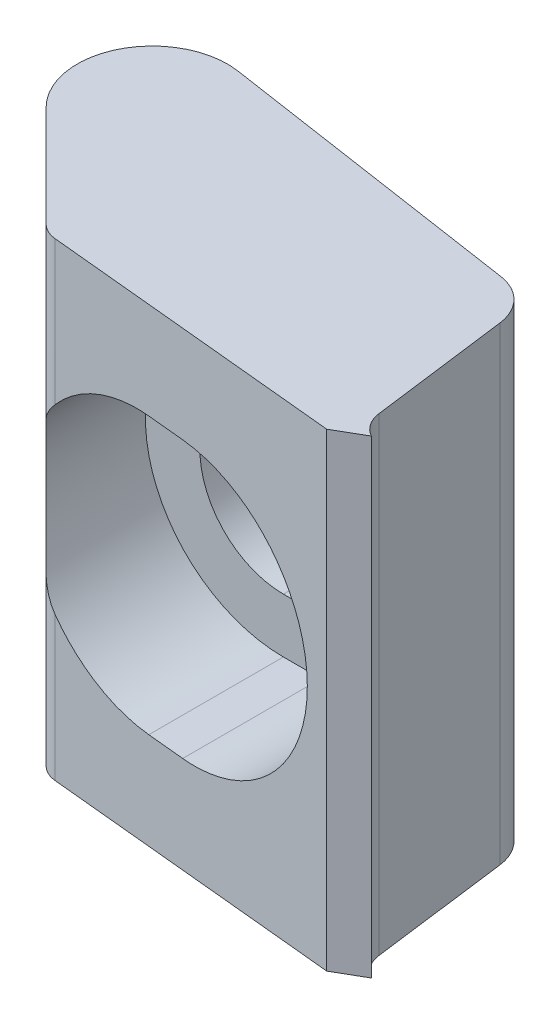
ISO-10303-21;
HEADER;
FILE_DESCRIPTION(('STEP AP214'),'2;1');
FILE_NAME('part.step','',(''),(''),'','','');
FILE_SCHEMA(('AUTOMOTIVE_DESIGN { 1 0 10303 214 1 1 1 1 }'));
ENDSEC;
DATA;
#1=APPLICATION_CONTEXT('core data for automotive mechanical design processes');
#2=APPLICATION_PROTOCOL_DEFINITION('international standard','automotive_design',2000,#1);
#3=PRODUCT_CONTEXT('',#1,'mechanical');
#4=PRODUCT('Part','Part','',(#3));
#5=PRODUCT_RELATED_PRODUCT_CATEGORY('part','',(#4));
#6=PRODUCT_DEFINITION_FORMATION('','',#4);
#7=PRODUCT_DEFINITION_CONTEXT('part definition',#1,'design');
#8=PRODUCT_DEFINITION('design','',#6,#7);
#9=PRODUCT_DEFINITION_SHAPE('','',#8);
#10=(LENGTH_UNIT() NAMED_UNIT(*) SI_UNIT(.MILLI.,.METRE.));
#11=(NAMED_UNIT(*) PLANE_ANGLE_UNIT() SI_UNIT($,.RADIAN.));
#12=(NAMED_UNIT(*) SI_UNIT($,.STERADIAN.) SOLID_ANGLE_UNIT());
#13=UNCERTAINTY_MEASURE_WITH_UNIT(LENGTH_MEASURE(1.E-05),#10,'distance_accuracy_value','');
#14=(GEOMETRIC_REPRESENTATION_CONTEXT(3) GLOBAL_UNCERTAINTY_ASSIGNED_CONTEXT((#13)) GLOBAL_UNIT_ASSIGNED_CONTEXT((#10,
#11,#12)) REPRESENTATION_CONTEXT('',''));
#15=CARTESIAN_POINT('',(0.,0.,0.));
#16=DIRECTION('',(0.,0.,1.));
#17=DIRECTION('',(1.,0.,0.));
#18=AXIS2_PLACEMENT_3D('',#15,#16,#17);
#19=CARTESIAN_POINT('',(-5.62274992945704,9.525,8.50138));
#20=DIRECTION('',(0.,-1.,0.));
#21=DIRECTION('',(1.,0.,0.));
#22=AXIS2_PLACEMENT_3D('',#19,#20,#21);
#23=CYLINDRICAL_SURFACE('',#22,1.143);
#24=DIRECTION('',(0.,-1.,0.));
#25=VECTOR('',#24,1.);
#26=CARTESIAN_POINT('',(-6.43105792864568,9.525,9.30951809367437));
#27=LINE('',#26,#25);
#28=CARTESIAN_POINT('',(-6.43105792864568,9.525,9.30951809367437));
#29=VERTEX_POINT('',#28);
#30=CARTESIAN_POINT('',(-6.43105792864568,2.69974498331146,9.30951809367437));
#31=VERTEX_POINT('',#30);
#32=EDGE_CURVE('E291',#29,#31,#27,.T.);
#33=ORIENTED_EDGE('',*,*,#32,.T.);
#34=CARTESIAN_POINT('',(-6.43105792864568,2.69974498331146,9.30951809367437));
#35=CARTESIAN_POINT('',(-6.41207355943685,2.73425249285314,9.32849929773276));
#36=CARTESIAN_POINT('',(-6.39254670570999,2.76888093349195,9.34670003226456));
#37=CARTESIAN_POINT('',(-6.35241597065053,2.83828205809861,9.38157648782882));
#38=CARTESIAN_POINT('',(-6.33181208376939,2.87305474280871,9.39825220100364));
#39=CARTESIAN_POINT('',(-6.2683273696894,2.97755695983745,9.44609795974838));
#40=CARTESIAN_POINT('',(-6.22383615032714,3.04735619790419,9.47502424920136));
#41=CARTESIAN_POINT('',(-6.13160979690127,3.18504417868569,9.52618937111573));
#42=CARTESIAN_POINT('',(-6.0839574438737,3.25294319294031,9.5485504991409));
#43=CARTESIAN_POINT('',(-5.9847903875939,3.38764944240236,9.58682732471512));
#44=CARTESIAN_POINT('',(-5.93328026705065,3.4544578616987,9.60275053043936));
#45=CARTESIAN_POINT('',(-5.85623345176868,3.54979165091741,9.62054322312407));
#46=CARTESIAN_POINT('',(-5.83215470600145,3.57897763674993,9.62530698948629));
#47=CARTESIAN_POINT('',(-5.78319663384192,3.63710530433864,9.63333551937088));
#48=CARTESIAN_POINT('',(-5.7583142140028,3.66604531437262,9.63659349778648));
#49=CARTESIAN_POINT('',(-5.73309687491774,3.69477252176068,9.6390410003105));
#50=B_SPLINE_CURVE_WITH_KNOTS('',3,(#34,#35,#36,#37,#38,#39,#40,#41,#42,#43,#44,#45,#46,#47,#48,
#49),.UNSPECIFIED.,.F.,.F.,(4,2,2,2,2,2,2,4),(0.,0.131135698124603,0.262272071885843,
0.524977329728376,0.78242292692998,1.03956740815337,1.15394072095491,1.26882449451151),.UNSPECIFIED.);
#51=CARTESIAN_POINT('',(-5.73309687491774,3.69477252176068,9.6390410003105));
#52=VERTEX_POINT('',#51);
#53=EDGE_CURVE('E200',#31,#52,#50,.T.);
#54=ORIENTED_EDGE('',*,*,#53,.T.);
#55=DIRECTION('',(0.,-1.,0.));
#56=VECTOR('',#55,1.);
#57=CARTESIAN_POINT('',(-5.73309687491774,9.525,9.6390410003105));
#58=LINE('',#57,#56);
#59=CARTESIAN_POINT('',(-5.73309687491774,9.525,9.6390410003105));
#60=VERTEX_POINT('',#59);
#61=EDGE_CURVE('E287',#60,#52,#58,.T.);
#62=ORIENTED_EDGE('',*,*,#61,.F.);
#63=CARTESIAN_POINT('',(-5.62274992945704,9.525,8.50138));
#64=DIRECTION('',(0.,1.,0.));
#65=DIRECTION('',(-1.,0.,0.));
#66=AXIS2_PLACEMENT_3D('',#63,#64,#65);
#67=CIRCLE('',#66,1.143);
#68=EDGE_CURVE('E274',#29,#60,#67,.T.);
#69=ORIENTED_EDGE('',*,*,#68,.F.);
#70=EDGE_LOOP('',(#33,#54,#62,#69));
#71=FACE_BOUND('',#70,.T.);
#72=ADVANCED_FACE('F14',(#71),#23,.T.);
#73=CARTESIAN_POINT('',(8.24565007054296,9.525,9.0551));
#74=DIRECTION('',(0.,-1.,0.));
#75=DIRECTION('',(1.,0.,0.));
#76=AXIS2_PLACEMENT_3D('',#73,#74,#75);
#77=CYLINDRICAL_SURFACE('',#76,1.27);
#78=CARTESIAN_POINT('',(8.24565007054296,-9.525,9.0551));
#79=DIRECTION('',(0.,-1.,0.));
#80=DIRECTION('',(-1.,0.,0.));
#81=AXIS2_PLACEMENT_3D('',#78,#79,#80);
#82=CIRCLE('',#81,1.27);
#83=CARTESIAN_POINT('',(7.62,-9.525,10.1602977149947));
#84=VERTEX_POINT('',#83);
#85=CARTESIAN_POINT('',(6.98616817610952,-9.525,9.21821148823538));
#86=VERTEX_POINT('',#85);
#87=EDGE_CURVE('E240',#84,#86,#82,.T.);
#88=ORIENTED_EDGE('',*,*,#87,.T.);
#89=DIRECTION('',(0.,-1.,0.));
#90=VECTOR('',#89,1.);
#91=CARTESIAN_POINT('',(6.98616817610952,9.525,9.21821148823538));
#92=LINE('',#91,#90);
#93=CARTESIAN_POINT('',(6.98616817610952,9.525,9.21821148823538));
#94=VERTEX_POINT('',#93);
#95=EDGE_CURVE('E306',#94,#86,#92,.T.);
#96=ORIENTED_EDGE('',*,*,#95,.F.);
#97=CARTESIAN_POINT('',(8.24565007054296,9.525,9.0551));
#98=DIRECTION('',(0.,-1.,0.));
#99=DIRECTION('',(-1.,0.,0.));
#100=AXIS2_PLACEMENT_3D('',#97,#98,#99);
#101=CIRCLE('',#100,1.27);
#102=CARTESIAN_POINT('',(7.62,9.525,10.1602977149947));
#103=VERTEX_POINT('',#102);
#104=EDGE_CURVE('E261',#103,#94,#101,.T.);
#105=ORIENTED_EDGE('',*,*,#104,.F.);
#106=DIRECTION('',(0.,-1.,0.));
#107=VECTOR('',#106,1.);
#108=CARTESIAN_POINT('',(7.62,9.525,10.1602977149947));
#109=LINE('',#108,#107);
#110=EDGE_CURVE('E280',#103,#84,#109,.T.);
#111=ORIENTED_EDGE('',*,*,#110,.T.);
#112=EDGE_LOOP('',(#88,#96,#105,#111));
#113=FACE_BOUND('',#112,.T.);
#114=ADVANCED_FACE('F16',(#113),#77,.F.);
#115=CARTESIAN_POINT('',(6.25375291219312,9.525,3.56279276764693));
#116=DIRECTION('',(-0.991718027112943,0.,0.128434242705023));
#117=DIRECTION('',(0.128434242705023,0.,0.991718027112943));
#118=AXIS2_PLACEMENT_3D('',#115,#116,#117);
#119=PLANE('',#118);
#120=DIRECTION('',(-0.128434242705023,0.,-0.991718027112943));
#121=VECTOR('',#120,1.);
#122=CARTESIAN_POINT('',(6.25375291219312,-9.525,3.56279276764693));
#123=LINE('',#122,#121);
#124=CARTESIAN_POINT('',(6.25375291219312,-9.525,3.56279276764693));
#125=VERTEX_POINT('',#124);
#126=EDGE_CURVE('E243',#86,#125,#123,.T.);
#127=ORIENTED_EDGE('',*,*,#126,.T.);
#128=DIRECTION('',(0.,-1.,0.));
#129=VECTOR('',#128,1.);
#130=CARTESIAN_POINT('',(6.25375291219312,9.525,3.56279276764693));
#131=LINE('',#130,#129);
#132=CARTESIAN_POINT('',(6.25375291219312,9.525,3.56279276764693));
#133=VERTEX_POINT('',#132);
#134=EDGE_CURVE('E303',#133,#125,#131,.T.);
#135=ORIENTED_EDGE('',*,*,#134,.F.);
#136=DIRECTION('',(-0.128434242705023,0.,-0.991718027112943));
#137=VECTOR('',#136,1.);
#138=CARTESIAN_POINT('',(6.25375291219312,9.525,3.56279276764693));
#139=LINE('',#138,#137);
#140=EDGE_CURVE('E264',#94,#133,#139,.T.);
#141=ORIENTED_EDGE('',*,*,#140,.F.);
#142=ORIENTED_EDGE('',*,*,#95,.T.);
#143=EDGE_LOOP('',(#127,#135,#141,#142));
#144=FACE_BOUND('',#143,.T.);
#145=ADVANCED_FACE('F370',(#144),#119,.F.);
#146=CARTESIAN_POINT('',(4.36453007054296,9.525,3.80746));
#147=DIRECTION('',(0.,-1.,0.));
#148=DIRECTION('',(1.,0.,0.));
#149=AXIS2_PLACEMENT_3D('',#146,#147,#148);
#150=CYLINDRICAL_SURFACE('',#149,1.905);
#151=CARTESIAN_POINT('',(4.36453007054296,-9.525,3.80746));
#152=DIRECTION('',(0.,1.,0.));
#153=DIRECTION('',(-1.,0.,0.));
#154=AXIS2_PLACEMENT_3D('',#151,#152,#153);
#155=CIRCLE('',#154,1.905);
#156=CARTESIAN_POINT('',(4.64761514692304,-9.525,1.92361079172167));
#157=VERTEX_POINT('',#156);
#158=EDGE_CURVE('E245',#125,#157,#155,.T.);
#159=ORIENTED_EDGE('',*,*,#158,.T.);
#160=DIRECTION('',(0.,-1.,0.));
#161=VECTOR('',#160,1.);
#162=CARTESIAN_POINT('',(4.64761514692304,9.525,1.92361079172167));
#163=LINE('',#162,#161);
#164=CARTESIAN_POINT('',(4.64761514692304,9.525,1.92361079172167));
#165=VERTEX_POINT('',#164);
#166=EDGE_CURVE('E300',#165,#157,#163,.T.);
#167=ORIENTED_EDGE('',*,*,#166,.F.);
#168=CARTESIAN_POINT('',(4.36453007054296,9.525,3.80746));
#169=DIRECTION('',(0.,1.,0.));
#170=DIRECTION('',(-1.,0.,0.));
#171=AXIS2_PLACEMENT_3D('',#168,#169,#170);
#172=CIRCLE('',#171,1.905);
#173=EDGE_CURVE('E266',#133,#165,#172,.T.);
#174=ORIENTED_EDGE('',*,*,#173,.F.);
#175=ORIENTED_EDGE('',*,*,#134,.T.);
#176=EDGE_LOOP('',(#159,#167,#174,#175));
#177=FACE_BOUND('',#176,.T.);
#178=ADVANCED_FACE('F367',(#177),#150,.T.);
#179=CARTESIAN_POINT('',(-7.92825380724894,9.525,0.0338412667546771));
#180=DIRECTION('',(-0.148601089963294,0.,0.988897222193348));
#181=DIRECTION('',(0.988897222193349,0.,0.148601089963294));
#182=AXIS2_PLACEMENT_3D('',#179,#180,#181);
#183=PLANE('',#182);
#184=DIRECTION('',(0.988897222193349,0.,0.148601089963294));
#185=VECTOR('',#184,1.);
#186=CARTESIAN_POINT('',(-7.92825380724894,-3.3909,0.0338412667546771));
#187=LINE('',#186,#185);
#188=CARTESIAN_POINT('',(-1.524,-3.3909,0.996205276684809));
#189=VERTEX_POINT('',#188);
#190=CARTESIAN_POINT('',(0.,-3.3909,1.2252159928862));
#191=VERTEX_POINT('',#190);
#192=EDGE_CURVE('E178',#189,#191,#187,.T.);
#193=ORIENTED_EDGE('',*,*,#192,.T.);
#194=CARTESIAN_POINT('',(0.,0.,1.2252159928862));
#195=DIRECTION('',(-0.148601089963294,0.,0.988897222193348));
#196=DIRECTION('',(0.988897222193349,0.,0.148601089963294));
#197=AXIS2_PLACEMENT_3D('',#194,#195,#196);
#198=ELLIPSE('',#197,3.42897110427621,3.3909);
#199=CARTESIAN_POINT('',(0.,3.3909,1.2252159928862));
#200=VERTEX_POINT('',#199);
#201=EDGE_CURVE('E181',#191,#200,#198,.T.);
#202=ORIENTED_EDGE('',*,*,#201,.T.);
#203=DIRECTION('',(-0.988897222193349,0.,-0.148601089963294));
#204=VECTOR('',#203,1.);
#205=CARTESIAN_POINT('',(-7.92825380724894,3.3909,0.0338412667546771));
#206=LINE('',#205,#204);
#207=CARTESIAN_POINT('',(-1.524,3.3909,0.996205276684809));
#208=VERTEX_POINT('',#207);
#209=EDGE_CURVE('E173',#200,#208,#206,.T.);
#210=ORIENTED_EDGE('',*,*,#209,.T.);
#211=CARTESIAN_POINT('',(-1.524,0.,0.996205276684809));
#212=DIRECTION('',(-0.148601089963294,0.,0.988897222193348));
#213=DIRECTION('',(0.988897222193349,0.,0.148601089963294));
#214=AXIS2_PLACEMENT_3D('',#211,#212,#213);
#215=ELLIPSE('',#214,3.4289711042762,3.3909);
#216=EDGE_CURVE('E153',#208,#189,#215,.T.);
#217=ORIENTED_EDGE('',*,*,#216,.T.);
#218=EDGE_LOOP('',(#193,#202,#210,#217));
#219=FACE_BOUND('',#218,.T.);
#220=DIRECTION('',(-0.988897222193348,0.,-0.148601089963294));
#221=VECTOR('',#220,1.);
#222=CARTESIAN_POINT('',(-7.92825380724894,-9.525,0.0338412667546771));
#223=LINE('',#222,#221);
#224=CARTESIAN_POINT('',(-7.92825380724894,-9.525,0.0338412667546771));
#225=VERTEX_POINT('',#224);
#226=EDGE_CURVE('E247',#157,#225,#223,.T.);
#227=ORIENTED_EDGE('',*,*,#226,.T.);
#228=DIRECTION('',(0.,-1.,0.));
#229=VECTOR('',#228,1.);
#230=CARTESIAN_POINT('',(-7.92825380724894,9.525,0.0338412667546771));
#231=LINE('',#230,#229);
#232=CARTESIAN_POINT('',(-7.92825380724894,9.525,0.0338412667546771));
#233=VERTEX_POINT('',#232);
#234=EDGE_CURVE('E297',#233,#225,#231,.T.);
#235=ORIENTED_EDGE('',*,*,#234,.F.);
#236=DIRECTION('',(-0.988897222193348,0.,-0.148601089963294));
#237=VECTOR('',#236,1.);
#238=CARTESIAN_POINT('',(-7.92825380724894,9.525,0.0338412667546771));
#239=LINE('',#238,#237);
#240=EDGE_CURVE('E268',#165,#233,#239,.T.);
#241=ORIENTED_EDGE('',*,*,#240,.F.);
#242=ORIENTED_EDGE('',*,*,#166,.T.);
#243=EDGE_LOOP('',(#227,#235,#241,#242));
#244=FACE_BOUND('',#243,.T.);
#245=ADVANCED_FACE('F363',(#219,#244),#183,.F.);
#246=CARTESIAN_POINT('',(-8.38118992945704,9.525,3.048));
#247=DIRECTION('',(0.,-1.,0.));
#248=DIRECTION('',(1.,0.,0.));
#249=AXIS2_PLACEMENT_3D('',#246,#247,#248);
#250=CYLINDRICAL_SURFACE('',#249,3.048);
#251=CARTESIAN_POINT('',(-8.38118992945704,-9.525,3.048));
#252=DIRECTION('',(0.,1.,0.));
#253=DIRECTION('',(-1.,0.,0.));
#254=AXIS2_PLACEMENT_3D('',#251,#252,#253);
#255=CIRCLE('',#254,3.048);
#256=CARTESIAN_POINT('',(-10.5366779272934,-9.525,5.20303491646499));
#257=VERTEX_POINT('',#256);
#258=EDGE_CURVE('E249',#225,#257,#255,.T.);
#259=ORIENTED_EDGE('',*,*,#258,.T.);
#260=DIRECTION('',(0.,-1.,0.));
#261=VECTOR('',#260,1.);
#262=CARTESIAN_POINT('',(-10.5366779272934,9.525,5.20303491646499));
#263=LINE('',#262,#261);
#264=CARTESIAN_POINT('',(-10.5366779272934,9.525,5.20303491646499));
#265=VERTEX_POINT('',#264);
#266=EDGE_CURVE('E294',#265,#257,#263,.T.);
#267=ORIENTED_EDGE('',*,*,#266,.F.);
#268=CARTESIAN_POINT('',(-8.38118992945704,9.525,3.048));
#269=DIRECTION('',(0.,1.,0.));
#270=DIRECTION('',(-1.,0.,0.));
#271=AXIS2_PLACEMENT_3D('',#268,#269,#270);
#272=CIRCLE('',#271,3.048);
#273=EDGE_CURVE('E270',#233,#265,#272,.T.);
#274=ORIENTED_EDGE('',*,*,#273,.F.);
#275=ORIENTED_EDGE('',*,*,#234,.T.);
#276=EDGE_LOOP('',(#259,#267,#274,#275));
#277=FACE_BOUND('',#276,.T.);
#278=ADVANCED_FACE('F359',(#277),#250,.T.);
#279=CARTESIAN_POINT('',(-6.43105792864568,9.525,9.30951809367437));
#280=DIRECTION('',(0.70718110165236,0.,-0.70703245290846));
#281=DIRECTION('',(-0.70703245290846,0.,-0.70718110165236));
#282=AXIS2_PLACEMENT_3D('',#279,#280,#281);
#283=PLANE('',#282);
#284=CARTESIAN_POINT('',(-6.43105792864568,-2.69974498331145,9.30951809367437));
#285=VERTEX_POINT('',#284);
#286=CARTESIAN_POINT('',(-6.43105792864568,-9.525,9.30951809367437));
#287=VERTEX_POINT('',#286);
#288=EDGE_CURVE('E290',#285,#287,#27,.T.);
#289=ORIENTED_EDGE('',*,*,#288,.F.);
#290=CARTESIAN_POINT('',(-1.524,0.,14.2176076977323));
#291=DIRECTION('',(0.70718110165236,0.,-0.70703245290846));
#292=DIRECTION('',(0.70703245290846,0.,0.70718110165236));
#293=AXIS2_PLACEMENT_3D('',#290,#291,#292);
#294=ELLIPSE('',#293,7.92141856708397,5.6007);
#295=EDGE_CURVE('E216',#285,#31,#294,.T.);
#296=ORIENTED_EDGE('',*,*,#295,.T.);
#297=ORIENTED_EDGE('',*,*,#32,.F.);
#298=DIRECTION('',(0.70703245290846,0.,0.70718110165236));
#299=VECTOR('',#298,1.);
#300=CARTESIAN_POINT('',(-6.43105792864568,9.525,9.30951809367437));
#301=LINE('',#300,#299);
#302=EDGE_CURVE('E272',#265,#29,#301,.T.);
#303=ORIENTED_EDGE('',*,*,#302,.F.);
#304=ORIENTED_EDGE('',*,*,#266,.T.);
#305=DIRECTION('',(0.70703245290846,0.,0.70718110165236));
#306=VECTOR('',#305,1.);
#307=CARTESIAN_POINT('',(-6.43105792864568,-9.525,9.30951809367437));
#308=LINE('',#307,#306);
#309=EDGE_CURVE('E251',#257,#287,#308,.T.);
#310=ORIENTED_EDGE('',*,*,#309,.T.);
#311=EDGE_LOOP('',(#289,#296,#297,#303,#304,#310));
#312=FACE_BOUND('',#311,.T.);
#313=ADVANCED_FACE('F330',(#312),#283,.F.);
#314=CARTESIAN_POINT('',(-5.73309687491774,-3.69477252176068,9.6390410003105));
#315=VERTEX_POINT('',#314);
#316=CARTESIAN_POINT('',(-5.73309687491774,-9.525,9.6390410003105));
#317=VERTEX_POINT('',#316);
#318=EDGE_CURVE('E286',#315,#317,#58,.T.);
#319=ORIENTED_EDGE('',*,*,#318,.F.);
#320=CARTESIAN_POINT('',(-5.73309687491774,-3.69477252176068,9.6390410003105));
#321=CARTESIAN_POINT('',(-5.78367712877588,-3.63716706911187,9.63410566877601));
#322=CARTESIAN_POINT('',(-5.83288842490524,-3.57870454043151,9.62595850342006));
#323=CARTESIAN_POINT('',(-5.92835495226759,-3.46052495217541,9.60386337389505));
#324=CARTESIAN_POINT('',(-5.97461191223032,-3.40080865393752,9.58991883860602));
#325=CARTESIAN_POINT('',(-6.06330824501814,-3.28145881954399,9.55710484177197));
#326=CARTESIAN_POINT('',(-6.10579624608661,-3.22183877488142,9.5383163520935));
#327=CARTESIAN_POINT('',(-6.18767321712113,-3.10213595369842,9.49608232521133));
#328=CARTESIAN_POINT('',(-6.2270626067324,-3.04205324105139,9.47263742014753));
#329=CARTESIAN_POINT('',(-6.29443738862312,-2.93493601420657,9.42688763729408));
#330=CARTESIAN_POINT('',(-6.32303616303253,-2.88791406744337,9.40544960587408));
#331=CARTESIAN_POINT('',(-6.37845187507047,-2.79376974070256,9.35966516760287));
#332=CARTESIAN_POINT('',(-6.40525649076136,-2.74664858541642,9.3353013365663));
#333=CARTESIAN_POINT('',(-6.43105792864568,-2.69974498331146,9.30951809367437));
#334=B_SPLINE_CURVE_WITH_KNOTS('',3,(#320,#321,#322,#323,#324,#325,#326,#327,#328,#329,#330,
#331,#332,#333),.UNSPECIFIED.,.F.,.F.,(4,2,2,2,2,2,4),(0.,0.230296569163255,0.460457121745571,
0.686994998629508,0.913502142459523,1.09060139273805,1.26881316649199),.UNSPECIFIED.);
#335=EDGE_CURVE('E233',#315,#285,#334,.T.);
#336=ORIENTED_EDGE('',*,*,#335,.T.);
#337=ORIENTED_EDGE('',*,*,#288,.T.);
#338=CARTESIAN_POINT('',(-5.62274992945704,-9.525,8.50138));
#339=DIRECTION('',(0.,1.,0.));
#340=DIRECTION('',(-1.,0.,0.));
#341=AXIS2_PLACEMENT_3D('',#338,#339,#340);
#342=CIRCLE('',#341,1.143);
#343=EDGE_CURVE('E254',#287,#317,#342,.T.);
#344=ORIENTED_EDGE('',*,*,#343,.T.);
#345=EDGE_LOOP('',(#319,#336,#337,#344));
#346=FACE_BOUND('',#345,.T.);
#347=ADVANCED_FACE('F218',(#346),#23,.T.);
#348=CARTESIAN_POINT('',(-5.73309687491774,9.525,9.6390410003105));
#349=DIRECTION('',(0.096541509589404,0.,-0.995328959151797));
#350=DIRECTION('',(-0.995328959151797,0.,-0.096541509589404));
#351=AXIS2_PLACEMENT_3D('',#348,#349,#350);
#352=PLANE('',#351);
#353=DIRECTION('',(-0.995328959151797,0.,-0.096541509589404));
#354=VECTOR('',#353,1.);
#355=CARTESIAN_POINT('',(-5.73309687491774,-5.6007,9.6390410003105));
#356=LINE('',#355,#354);
#357=CARTESIAN_POINT('',(0.,-5.6007,10.195120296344));
#358=VERTEX_POINT('',#357);
#359=CARTESIAN_POINT('',(-1.524,-5.6007,10.0473005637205));
#360=VERTEX_POINT('',#359);
#361=EDGE_CURVE('E18',#358,#360,#356,.T.);
#362=ORIENTED_EDGE('',*,*,#361,.T.);
#363=CARTESIAN_POINT('',(-1.524,0.,10.0473005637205));
#364=DIRECTION('',(0.096541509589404,0.,-0.995328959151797));
#365=DIRECTION('',(0.995328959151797,0.,0.096541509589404));
#366=AXIS2_PLACEMENT_3D('',#363,#364,#365);
#367=ELLIPSE('',#366,5.62698387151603,5.6007);
#368=EDGE_CURVE('E9',#360,#315,#367,.T.);
#369=ORIENTED_EDGE('',*,*,#368,.T.);
#370=ORIENTED_EDGE('',*,*,#318,.T.);
#371=DIRECTION('',(0.995328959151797,0.,0.096541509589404));
#372=VECTOR('',#371,1.);
#373=CARTESIAN_POINT('',(-5.73309687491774,-9.525,9.6390410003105));
#374=LINE('',#373,#372);
#375=CARTESIAN_POINT('',(6.47273007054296,-9.525,10.82294));
#376=VERTEX_POINT('',#375);
#377=EDGE_CURVE('E257',#317,#376,#374,.T.);
#378=ORIENTED_EDGE('',*,*,#377,.T.);
#379=DIRECTION('',(0.,-1.,0.));
#380=VECTOR('',#379,1.);
#381=CARTESIAN_POINT('',(6.47273007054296,9.525,10.82294));
#382=LINE('',#381,#380);
#383=CARTESIAN_POINT('',(6.47273007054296,9.525,10.82294));
#384=VERTEX_POINT('',#383);
#385=EDGE_CURVE('E283',#384,#376,#382,.T.);
#386=ORIENTED_EDGE('',*,*,#385,.F.);
#387=DIRECTION('',(0.995328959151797,0.,0.096541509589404));
#388=VECTOR('',#387,1.);
#389=CARTESIAN_POINT('',(-5.73309687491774,9.525,9.6390410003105));
#390=LINE('',#389,#388);
#391=EDGE_CURVE('E276',#60,#384,#390,.T.);
#392=ORIENTED_EDGE('',*,*,#391,.F.);
#393=ORIENTED_EDGE('',*,*,#61,.T.);
#394=CARTESIAN_POINT('',(-1.524,5.6007,10.0473005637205));
#395=VERTEX_POINT('',#394);
#396=EDGE_CURVE('E24',#52,#395,#367,.T.);
#397=ORIENTED_EDGE('',*,*,#396,.T.);
#398=DIRECTION('',(0.995328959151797,0.,0.096541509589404));
#399=VECTOR('',#398,1.);
#400=CARTESIAN_POINT('',(-5.73309687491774,5.6007,9.6390410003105));
#401=LINE('',#400,#399);
#402=CARTESIAN_POINT('',(0.,5.6007,10.195120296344));
#403=VERTEX_POINT('',#402);
#404=EDGE_CURVE('E309',#395,#403,#401,.T.);
#405=ORIENTED_EDGE('',*,*,#404,.T.);
#406=CARTESIAN_POINT('',(0.,0.,10.195120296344));
#407=DIRECTION('',(0.096541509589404,0.,-0.995328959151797));
#408=DIRECTION('',(0.995328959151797,0.,0.096541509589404));
#409=AXIS2_PLACEMENT_3D('',#406,#407,#408);
#410=ELLIPSE('',#409,5.62698387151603,5.6007);
#411=EDGE_CURVE('E312',#403,#358,#410,.T.);
#412=ORIENTED_EDGE('',*,*,#411,.T.);
#413=EDGE_LOOP('',(#362,#369,#370,#378,#386,#392,#393,#397,#405,#412));
#414=FACE_BOUND('',#413,.T.);
#415=ADVANCED_FACE('F317',(#414),#352,.F.);
#416=CARTESIAN_POINT('',(6.47273007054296,9.525,10.82294));
#417=DIRECTION('',(-0.50015039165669,0.,-0.865938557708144));
#418=DIRECTION('',(-0.865938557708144,0.,0.50015039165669));
#419=AXIS2_PLACEMENT_3D('',#416,#417,#418);
#420=PLANE('',#419);
#421=DIRECTION('',(0.865938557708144,0.,-0.50015039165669));
#422=VECTOR('',#421,1.);
#423=CARTESIAN_POINT('',(6.47273007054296,-9.525,10.82294));
#424=LINE('',#423,#422);
#425=EDGE_CURVE('E259',#376,#84,#424,.T.);
#426=ORIENTED_EDGE('',*,*,#425,.T.);
#427=ORIENTED_EDGE('',*,*,#110,.F.);
#428=DIRECTION('',(0.865938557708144,0.,-0.50015039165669));
#429=VECTOR('',#428,1.);
#430=CARTESIAN_POINT('',(6.47273007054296,9.525,10.82294));
#431=LINE('',#430,#429);
#432=EDGE_CURVE('E278',#384,#103,#431,.T.);
#433=ORIENTED_EDGE('',*,*,#432,.F.);
#434=ORIENTED_EDGE('',*,*,#385,.T.);
#435=EDGE_LOOP('',(#426,#427,#433,#434));
#436=FACE_BOUND('',#435,.T.);
#437=ADVANCED_FACE('F346',(#436),#420,.F.);
#438=CARTESIAN_POINT('',(8.24565007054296,9.525,9.0551));
#439=DIRECTION('',(0.,1.,0.));
#440=DIRECTION('',(-1.,0.,0.));
#441=AXIS2_PLACEMENT_3D('',#438,#439,#440);
#442=PLANE('',#441);
#443=ORIENTED_EDGE('',*,*,#104,.T.);
#444=ORIENTED_EDGE('',*,*,#140,.T.);
#445=ORIENTED_EDGE('',*,*,#173,.T.);
#446=ORIENTED_EDGE('',*,*,#240,.T.);
#447=ORIENTED_EDGE('',*,*,#273,.T.);
#448=ORIENTED_EDGE('',*,*,#302,.T.);
#449=ORIENTED_EDGE('',*,*,#68,.T.);
#450=ORIENTED_EDGE('',*,*,#391,.T.);
#451=ORIENTED_EDGE('',*,*,#432,.T.);
#452=EDGE_LOOP('',(#443,#444,#445,#446,#447,#448,#449,#450,#451));
#453=FACE_BOUND('',#452,.T.);
#454=ADVANCED_FACE('F350',(#453),#442,.T.);
#455=CARTESIAN_POINT('',(8.24565007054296,-9.525,9.0551));
#456=DIRECTION('',(0.,1.,0.));
#457=DIRECTION('',(-1.,0.,0.));
#458=AXIS2_PLACEMENT_3D('',#455,#456,#457);
#459=PLANE('',#458);
#460=ORIENTED_EDGE('',*,*,#87,.F.);
#461=ORIENTED_EDGE('',*,*,#425,.F.);
#462=ORIENTED_EDGE('',*,*,#377,.F.);
#463=ORIENTED_EDGE('',*,*,#343,.F.);
#464=ORIENTED_EDGE('',*,*,#309,.F.);
#465=ORIENTED_EDGE('',*,*,#258,.F.);
#466=ORIENTED_EDGE('',*,*,#226,.F.);
#467=ORIENTED_EDGE('',*,*,#158,.F.);
#468=ORIENTED_EDGE('',*,*,#126,.F.);
#469=EDGE_LOOP('',(#460,#461,#462,#463,#464,#465,#466,#467,#468));
#470=FACE_BOUND('',#469,.T.);
#471=ADVANCED_FACE('F340',(#470),#459,.F.);
#472=CARTESIAN_POINT('',(0.,0.,4.5847));
#473=DIRECTION('',(0.,0.,1.));
#474=DIRECTION('',(0.,1.,0.));
#475=AXIS2_PLACEMENT_3D('',#472,#473,#474);
#476=CYLINDRICAL_SURFACE('',#475,5.6007);
#477=DIRECTION('',(0.,0.,1.));
#478=VECTOR('',#477,1.);
#479=CARTESIAN_POINT('',(0.,5.6007,4.5847));
#480=LINE('',#479,#478);
#481=CARTESIAN_POINT('',(0.,5.6007,4.5847));
#482=VERTEX_POINT('',#481);
#483=EDGE_CURVE('E196',#482,#403,#480,.T.);
#484=ORIENTED_EDGE('',*,*,#483,.F.);
#485=CARTESIAN_POINT('',(0.,0.,4.5847));
#486=DIRECTION('',(0.,0.,1.));
#487=DIRECTION('',(0.,1.,0.));
#488=AXIS2_PLACEMENT_3D('',#485,#486,#487);
#489=CIRCLE('',#488,5.6007);
#490=CARTESIAN_POINT('',(0.,-5.6007,4.5847));
#491=VERTEX_POINT('',#490);
#492=EDGE_CURVE('E184',#491,#482,#489,.T.);
#493=ORIENTED_EDGE('',*,*,#492,.F.);
#494=DIRECTION('',(0.,0.,1.));
#495=VECTOR('',#494,1.);
#496=CARTESIAN_POINT('',(0.,-5.6007,4.5847));
#497=LINE('',#496,#495);
#498=EDGE_CURVE('E197',#491,#358,#497,.T.);
#499=ORIENTED_EDGE('',*,*,#498,.T.);
#500=ORIENTED_EDGE('',*,*,#411,.F.);
#501=EDGE_LOOP('',(#484,#493,#499,#500));
#502=FACE_BOUND('',#501,.T.);
#503=ADVANCED_FACE('F323',(#502),#476,.F.);
#504=CARTESIAN_POINT('',(0.,-5.6007,4.5847));
#505=DIRECTION('',(0.,-1.,0.));
#506=DIRECTION('',(1.,0.,0.));
#507=AXIS2_PLACEMENT_3D('',#504,#505,#506);
#508=PLANE('',#507);
#509=ORIENTED_EDGE('',*,*,#498,.F.);
#510=DIRECTION('',(1.,0.,0.));
#511=VECTOR('',#510,1.);
#512=CARTESIAN_POINT('',(0.,-5.6007,4.5847));
#513=LINE('',#512,#511);
#514=CARTESIAN_POINT('',(-1.524,-5.6007,4.5847));
#515=VERTEX_POINT('',#514);
#516=EDGE_CURVE('E193',#515,#491,#513,.T.);
#517=ORIENTED_EDGE('',*,*,#516,.F.);
#518=DIRECTION('',(0.,0.,1.));
#519=VECTOR('',#518,1.);
#520=CARTESIAN_POINT('',(-1.524,-5.6007,4.5847));
#521=LINE('',#520,#519);
#522=EDGE_CURVE('E201',#515,#360,#521,.T.);
#523=ORIENTED_EDGE('',*,*,#522,.T.);
#524=ORIENTED_EDGE('',*,*,#361,.F.);
#525=EDGE_LOOP('',(#509,#517,#523,#524));
#526=FACE_BOUND('',#525,.T.);
#527=ADVANCED_FACE('F228',(#526),#508,.F.);
#528=CARTESIAN_POINT('',(-1.524,0.,4.5847));
#529=DIRECTION('',(0.,0.,1.));
#530=DIRECTION('',(0.,1.,0.));
#531=AXIS2_PLACEMENT_3D('',#528,#529,#530);
#532=CYLINDRICAL_SURFACE('',#531,5.6007);
#533=ORIENTED_EDGE('',*,*,#522,.F.);
#534=CARTESIAN_POINT('',(-1.524,0.,4.5847));
#535=DIRECTION('',(0.,0.,1.));
#536=DIRECTION('',(0.,1.,0.));
#537=AXIS2_PLACEMENT_3D('',#534,#535,#536);
#538=CIRCLE('',#537,5.6007);
#539=CARTESIAN_POINT('',(-1.524,5.6007,4.5847));
#540=VERTEX_POINT('',#539);
#541=EDGE_CURVE('E190',#540,#515,#538,.T.);
#542=ORIENTED_EDGE('',*,*,#541,.F.);
#543=DIRECTION('',(0.,0.,1.));
#544=VECTOR('',#543,1.);
#545=CARTESIAN_POINT('',(-1.524,5.6007,4.5847));
#546=LINE('',#545,#544);
#547=EDGE_CURVE('E204',#540,#395,#546,.T.);
#548=ORIENTED_EDGE('',*,*,#547,.T.);
#549=ORIENTED_EDGE('',*,*,#396,.F.);
#550=ORIENTED_EDGE('',*,*,#53,.F.);
#551=ORIENTED_EDGE('',*,*,#295,.F.);
#552=ORIENTED_EDGE('',*,*,#335,.F.);
#553=ORIENTED_EDGE('',*,*,#368,.F.);
#554=EDGE_LOOP('',(#533,#542,#548,#549,#550,#551,#552,#553));
#555=FACE_BOUND('',#554,.T.);
#556=ADVANCED_FACE('F222',(#555),#532,.F.);
#557=CARTESIAN_POINT('',(0.,5.6007,4.5847));
#558=DIRECTION('',(0.,1.,0.));
#559=DIRECTION('',(-1.,0.,0.));
#560=AXIS2_PLACEMENT_3D('',#557,#558,#559);
#561=PLANE('',#560);
#562=ORIENTED_EDGE('',*,*,#547,.F.);
#563=DIRECTION('',(-1.,0.,0.));
#564=VECTOR('',#563,1.);
#565=CARTESIAN_POINT('',(0.,5.6007,4.5847));
#566=LINE('',#565,#564);
#567=EDGE_CURVE('E187',#482,#540,#566,.T.);
#568=ORIENTED_EDGE('',*,*,#567,.F.);
#569=ORIENTED_EDGE('',*,*,#483,.T.);
#570=ORIENTED_EDGE('',*,*,#404,.F.);
#571=EDGE_LOOP('',(#562,#568,#569,#570));
#572=FACE_BOUND('',#571,.T.);
#573=ADVANCED_FACE('F227',(#572),#561,.F.);
#574=CARTESIAN_POINT('',(0.,0.,4.5847));
#575=DIRECTION('',(0.,0.,1.));
#576=DIRECTION('',(0.,1.,0.));
#577=AXIS2_PLACEMENT_3D('',#574,#575,#576);
#578=PLANE('',#577);
#579=CARTESIAN_POINT('',(0.,0.,4.5847));
#580=DIRECTION('',(0.,0.,1.));
#581=DIRECTION('',(0.,1.,0.));
#582=AXIS2_PLACEMENT_3D('',#579,#580,#581);
#583=CIRCLE('',#582,3.3909);
#584=CARTESIAN_POINT('',(0.,-3.3909,4.5847));
#585=VERTEX_POINT('',#584);
#586=CARTESIAN_POINT('',(0.,3.3909,4.5847));
#587=VERTEX_POINT('',#586);
#588=EDGE_CURVE('E39',#585,#587,#583,.T.);
#589=ORIENTED_EDGE('',*,*,#588,.F.);
#590=DIRECTION('',(1.,0.,0.));
#591=VECTOR('',#590,1.);
#592=CARTESIAN_POINT('',(-1.524,-3.3909,4.5847));
#593=LINE('',#592,#591);
#594=CARTESIAN_POINT('',(-1.524,-3.3909,4.5847));
#595=VERTEX_POINT('',#594);
#596=EDGE_CURVE('E166',#595,#585,#593,.T.);
#597=ORIENTED_EDGE('',*,*,#596,.F.);
#598=CARTESIAN_POINT('',(-1.524,0.,4.5847));
#599=DIRECTION('',(0.,0.,1.));
#600=DIRECTION('',(0.,1.,0.));
#601=AXIS2_PLACEMENT_3D('',#598,#599,#600);
#602=CIRCLE('',#601,3.3909);
#603=CARTESIAN_POINT('',(-1.524,3.3909,4.5847));
#604=VERTEX_POINT('',#603);
#605=EDGE_CURVE('E150',#604,#595,#602,.T.);
#606=ORIENTED_EDGE('',*,*,#605,.F.);
#607=DIRECTION('',(-1.,0.,0.));
#608=VECTOR('',#607,1.);
#609=CARTESIAN_POINT('',(0.,3.3909,4.5847));
#610=LINE('',#609,#608);
#611=EDGE_CURVE('E159',#587,#604,#610,.T.);
#612=ORIENTED_EDGE('',*,*,#611,.F.);
#613=EDGE_LOOP('',(#589,#597,#606,#612));
#614=FACE_BOUND('',#613,.T.);
#615=ORIENTED_EDGE('',*,*,#492,.T.);
#616=ORIENTED_EDGE('',*,*,#567,.T.);
#617=ORIENTED_EDGE('',*,*,#541,.T.);
#618=ORIENTED_EDGE('',*,*,#516,.T.);
#619=EDGE_LOOP('',(#615,#616,#617,#618));
#620=FACE_BOUND('',#619,.T.);
#621=ADVANCED_FACE('F163',(#614,#620),#578,.T.);
#622=CARTESIAN_POINT('',(0.,0.,0.));
#623=DIRECTION('',(0.,0.,1.));
#624=DIRECTION('',(0.,1.,0.));
#625=AXIS2_PLACEMENT_3D('',#622,#623,#624);
#626=CYLINDRICAL_SURFACE('',#625,3.3909);
#627=DIRECTION('',(0.,0.,1.));
#628=VECTOR('',#627,1.);
#629=CARTESIAN_POINT('',(0.,-3.3909,0.));
#630=LINE('',#629,#628);
#631=EDGE_CURVE('E171',#191,#585,#630,.T.);
#632=ORIENTED_EDGE('',*,*,#631,.T.);
#633=ORIENTED_EDGE('',*,*,#588,.T.);
#634=DIRECTION('',(0.,0.,1.));
#635=VECTOR('',#634,1.);
#636=CARTESIAN_POINT('',(0.,3.3909,0.));
#637=LINE('',#636,#635);
#638=EDGE_CURVE('E156',#200,#587,#637,.T.);
#639=ORIENTED_EDGE('',*,*,#638,.F.);
#640=ORIENTED_EDGE('',*,*,#201,.F.);
#641=EDGE_LOOP('',(#632,#633,#639,#640));
#642=FACE_BOUND('',#641,.T.);
#643=ADVANCED_FACE('F471',(#642),#626,.F.);
#644=CARTESIAN_POINT('',(-1.524,-3.3909,0.));
#645=DIRECTION('',(0.,-1.,0.));
#646=DIRECTION('',(1.,0.,0.));
#647=AXIS2_PLACEMENT_3D('',#644,#645,#646);
#648=PLANE('',#647);
#649=DIRECTION('',(0.,0.,1.));
#650=VECTOR('',#649,1.);
#651=CARTESIAN_POINT('',(-1.524,-3.3909,0.));
#652=LINE('',#651,#650);
#653=EDGE_CURVE('E155',#189,#595,#652,.T.);
#654=ORIENTED_EDGE('',*,*,#653,.T.);
#655=ORIENTED_EDGE('',*,*,#596,.T.);
#656=ORIENTED_EDGE('',*,*,#631,.F.);
#657=ORIENTED_EDGE('',*,*,#192,.F.);
#658=EDGE_LOOP('',(#654,#655,#656,#657));
#659=FACE_BOUND('',#658,.T.);
#660=ADVANCED_FACE('F478',(#659),#648,.F.);
#661=CARTESIAN_POINT('',(-1.524,0.,0.));
#662=DIRECTION('',(0.,0.,1.));
#663=DIRECTION('',(0.,1.,0.));
#664=AXIS2_PLACEMENT_3D('',#661,#662,#663);
#665=CYLINDRICAL_SURFACE('',#664,3.3909);
#666=DIRECTION('',(0.,0.,1.));
#667=VECTOR('',#666,1.);
#668=CARTESIAN_POINT('',(-1.524,3.3909,0.));
#669=LINE('',#668,#667);
#670=EDGE_CURVE('E31',#208,#604,#669,.T.);
#671=ORIENTED_EDGE('',*,*,#670,.T.);
#672=ORIENTED_EDGE('',*,*,#605,.T.);
#673=ORIENTED_EDGE('',*,*,#653,.F.);
#674=ORIENTED_EDGE('',*,*,#216,.F.);
#675=EDGE_LOOP('',(#671,#672,#673,#674));
#676=FACE_BOUND('',#675,.T.);
#677=ADVANCED_FACE('F147',(#676),#665,.F.);
#678=CARTESIAN_POINT('',(0.,3.3909,0.));
#679=DIRECTION('',(0.,1.,0.));
#680=DIRECTION('',(-1.,0.,0.));
#681=AXIS2_PLACEMENT_3D('',#678,#679,#680);
#682=PLANE('',#681);
#683=ORIENTED_EDGE('',*,*,#638,.T.);
#684=ORIENTED_EDGE('',*,*,#611,.T.);
#685=ORIENTED_EDGE('',*,*,#670,.F.);
#686=ORIENTED_EDGE('',*,*,#209,.F.);
#687=EDGE_LOOP('',(#683,#684,#685,#686));
#688=FACE_BOUND('',#687,.T.);
#689=ADVANCED_FACE('F160',(#688),#682,.F.);
#690=CLOSED_SHELL('',(#72,#114,#145,#178,#245,#278,#313,#347,#415,#437,#454,#471,#503,#527,#556,
#573,#621,#643,#660,#677,#689));
#691=MANIFOLD_SOLID_BREP('B1',#690);
#692=ADVANCED_BREP_SHAPE_REPRESENTATION('',(#18,#691),#14);
#693=SHAPE_DEFINITION_REPRESENTATION(#9,#692);
ENDSEC;
END-ISO-10303-21;
